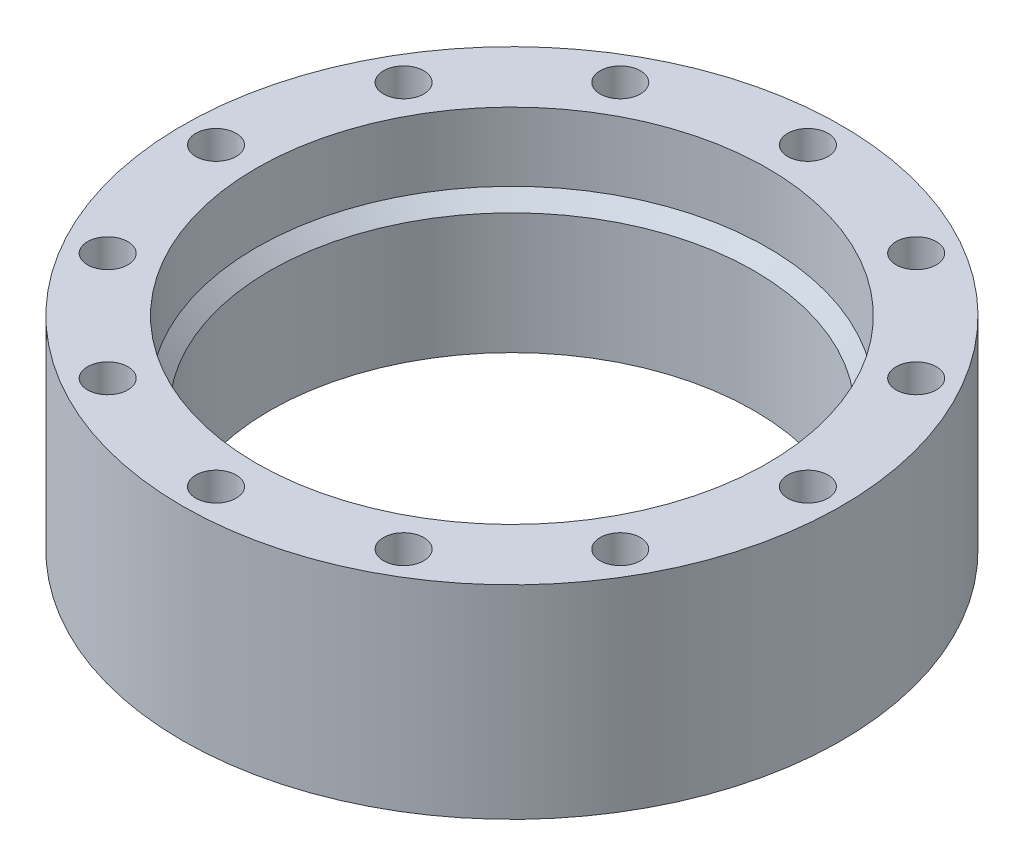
ISO-10303-21;
HEADER;
FILE_DESCRIPTION(('STEP AP214'),'2;1');
FILE_NAME('part.step','',(''),(''),'','','');
FILE_SCHEMA(('AUTOMOTIVE_DESIGN { 1 0 10303 214 1 1 1 1 }'));
ENDSEC;
DATA;
#1=APPLICATION_CONTEXT('core data for automotive mechanical design processes');
#2=APPLICATION_PROTOCOL_DEFINITION('international standard','automotive_design',2000,#1);
#3=PRODUCT_CONTEXT('',#1,'mechanical');
#4=PRODUCT('Part','Part','',(#3));
#5=PRODUCT_RELATED_PRODUCT_CATEGORY('part','',(#4));
#6=PRODUCT_DEFINITION_FORMATION('','',#4);
#7=PRODUCT_DEFINITION_CONTEXT('part definition',#1,'design');
#8=PRODUCT_DEFINITION('design','',#6,#7);
#9=PRODUCT_DEFINITION_SHAPE('','',#8);
#10=(LENGTH_UNIT() NAMED_UNIT(*) SI_UNIT(.MILLI.,.METRE.));
#11=(NAMED_UNIT(*) PLANE_ANGLE_UNIT() SI_UNIT($,.RADIAN.));
#12=(NAMED_UNIT(*) SI_UNIT($,.STERADIAN.) SOLID_ANGLE_UNIT());
#13=UNCERTAINTY_MEASURE_WITH_UNIT(LENGTH_MEASURE(1.E-05),#10,'distance_accuracy_value','');
#14=(GEOMETRIC_REPRESENTATION_CONTEXT(3) GLOBAL_UNCERTAINTY_ASSIGNED_CONTEXT((#13)) GLOBAL_UNIT_ASSIGNED_CONTEXT((#10,
#11,#12)) REPRESENTATION_CONTEXT('',''));
#15=CARTESIAN_POINT('',(0.,0.,0.));
#16=DIRECTION('',(0.,0.,1.));
#17=DIRECTION('',(1.,0.,0.));
#18=AXIS2_PLACEMENT_3D('',#15,#16,#17);
#19=CARTESIAN_POINT('',(0.,15.1,0.));
#20=DIRECTION('',(0.,1.,0.));
#21=DIRECTION('',(0.,0.,1.));
#22=AXIS2_PLACEMENT_3D('',#19,#20,#21);
#23=PLANE('',#22);
#24=CARTESIAN_POINT('',(-19.0525588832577,15.1,10.9999999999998));
#25=DIRECTION('',(0.,1.,0.));
#26=DIRECTION('',(0.,0.,1.));
#27=AXIS2_PLACEMENT_3D('',#24,#25,#26);
#28=CIRCLE('',#27,1.5);
#29=CARTESIAN_POINT('',(-19.0525588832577,15.1,12.4999999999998));
#30=VERTEX_POINT('',#29);
#31=EDGE_CURVE('E115',#30,#30,#28,.T.);
#32=ORIENTED_EDGE('',*,*,#31,.F.);
#33=EDGE_LOOP('',(#32));
#34=FACE_BOUND('',#33,.T.);
#35=CARTESIAN_POINT('',(-11.0000000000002,15.1,19.0525588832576));
#36=DIRECTION('',(0.,1.,0.));
#37=DIRECTION('',(0.,0.,1.));
#38=AXIS2_PLACEMENT_3D('',#35,#36,#37);
#39=CIRCLE('',#38,1.5);
#40=CARTESIAN_POINT('',(-11.0000000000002,15.1,20.5525588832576));
#41=VERTEX_POINT('',#40);
#42=EDGE_CURVE('E123',#41,#41,#39,.T.);
#43=ORIENTED_EDGE('',*,*,#42,.F.);
#44=EDGE_LOOP('',(#43));
#45=FACE_BOUND('',#44,.T.);
#46=CARTESIAN_POINT('',(-1.53602910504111E-13,15.1,22.));
#47=DIRECTION('',(0.,1.,0.));
#48=DIRECTION('',(0.,0.,1.));
#49=AXIS2_PLACEMENT_3D('',#46,#47,#48);
#50=CIRCLE('',#49,1.5);
#51=CARTESIAN_POINT('',(-1.53602910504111E-13,15.1,23.5));
#52=VERTEX_POINT('',#51);
#53=EDGE_CURVE('E129',#52,#52,#50,.T.);
#54=ORIENTED_EDGE('',*,*,#53,.F.);
#55=EDGE_LOOP('',(#54));
#56=FACE_BOUND('',#55,.T.);
#57=CARTESIAN_POINT('',(10.9999999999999,15.1,19.0525588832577));
#58=DIRECTION('',(0.,1.,0.));
#59=DIRECTION('',(0.,0.,1.));
#60=AXIS2_PLACEMENT_3D('',#57,#58,#59);
#61=CIRCLE('',#60,1.5);
#62=CARTESIAN_POINT('',(10.9999999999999,15.1,20.5525588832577));
#63=VERTEX_POINT('',#62);
#64=EDGE_CURVE('E83',#63,#63,#61,.T.);
#65=ORIENTED_EDGE('',*,*,#64,.F.);
#66=EDGE_LOOP('',(#65));
#67=FACE_BOUND('',#66,.T.);
#68=CARTESIAN_POINT('',(19.0525588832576,15.1,11.0000000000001));
#69=DIRECTION('',(0.,1.,0.));
#70=DIRECTION('',(0.,0.,1.));
#71=AXIS2_PLACEMENT_3D('',#68,#69,#70);
#72=CIRCLE('',#71,1.5);
#73=CARTESIAN_POINT('',(19.0525588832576,15.1,12.5000000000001));
#74=VERTEX_POINT('',#73);
#75=EDGE_CURVE('E76',#74,#74,#72,.T.);
#76=ORIENTED_EDGE('',*,*,#75,.F.);
#77=EDGE_LOOP('',(#76));
#78=FACE_BOUND('',#77,.T.);
#79=CARTESIAN_POINT('',(22.,15.1,0.));
#80=DIRECTION('',(0.,1.,0.));
#81=DIRECTION('',(0.,0.,1.));
#82=AXIS2_PLACEMENT_3D('',#79,#80,#81);
#83=CIRCLE('',#82,1.5);
#84=CARTESIAN_POINT('',(22.,15.1,1.50000000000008));
#85=VERTEX_POINT('',#84);
#86=EDGE_CURVE('E90',#85,#85,#83,.T.);
#87=ORIENTED_EDGE('',*,*,#86,.F.);
#88=EDGE_LOOP('',(#87));
#89=FACE_BOUND('',#88,.T.);
#90=CARTESIAN_POINT('',(19.0525588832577,15.1,-11.));
#91=DIRECTION('',(0.,1.,0.));
#92=DIRECTION('',(0.,0.,1.));
#93=AXIS2_PLACEMENT_3D('',#90,#91,#92);
#94=CIRCLE('',#93,1.5);
#95=CARTESIAN_POINT('',(19.0525588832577,15.1,-9.49999999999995));
#96=VERTEX_POINT('',#95);
#97=EDGE_CURVE('E100',#96,#96,#94,.T.);
#98=ORIENTED_EDGE('',*,*,#97,.F.);
#99=EDGE_LOOP('',(#98));
#100=FACE_BOUND('',#99,.T.);
#101=CARTESIAN_POINT('',(11.,15.1,-19.0525588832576));
#102=DIRECTION('',(0.,1.,0.));
#103=DIRECTION('',(0.,0.,1.));
#104=AXIS2_PLACEMENT_3D('',#101,#102,#103);
#105=CIRCLE('',#104,1.5);
#106=CARTESIAN_POINT('',(11.,15.1,-17.5525588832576));
#107=VERTEX_POINT('',#106);
#108=EDGE_CURVE('E75',#107,#107,#105,.T.);
#109=ORIENTED_EDGE('',*,*,#108,.F.);
#110=EDGE_LOOP('',(#109));
#111=FACE_BOUND('',#110,.T.);
#112=CARTESIAN_POINT('',(-22.,15.1,-2.3041549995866E-13));
#113=DIRECTION('',(0.,1.,0.));
#114=DIRECTION('',(0.,0.,1.));
#115=AXIS2_PLACEMENT_3D('',#112,#113,#114);
#116=CIRCLE('',#115,1.5);
#117=CARTESIAN_POINT('',(-22.,15.1,1.49999999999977));
#118=VERTEX_POINT('',#117);
#119=EDGE_CURVE('E114',#118,#118,#116,.T.);
#120=ORIENTED_EDGE('',*,*,#119,.F.);
#121=EDGE_LOOP('',(#120));
#122=FACE_BOUND('',#121,.T.);
#123=CARTESIAN_POINT('',(-19.0525588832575,15.1,-11.0000000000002));
#124=DIRECTION('',(0.,1.,0.));
#125=DIRECTION('',(0.,0.,1.));
#126=AXIS2_PLACEMENT_3D('',#123,#124,#125);
#127=CIRCLE('',#126,1.5);
#128=CARTESIAN_POINT('',(-19.0525588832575,15.1,-9.50000000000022));
#129=VERTEX_POINT('',#128);
#130=EDGE_CURVE('E153',#129,#129,#127,.T.);
#131=ORIENTED_EDGE('',*,*,#130,.F.);
#132=EDGE_LOOP('',(#131));
#133=FACE_BOUND('',#132,.T.);
#134=CARTESIAN_POINT('',(-10.9999999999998,15.1,-19.0525588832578));
#135=DIRECTION('',(0.,1.,0.));
#136=DIRECTION('',(0.,0.,1.));
#137=AXIS2_PLACEMENT_3D('',#134,#135,#136);
#138=CIRCLE('',#137,1.5);
#139=CARTESIAN_POINT('',(-10.9999999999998,15.1,-17.5525588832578));
#140=VERTEX_POINT('',#139);
#141=EDGE_CURVE('E145',#140,#140,#138,.T.);
#142=ORIENTED_EDGE('',*,*,#141,.F.);
#143=EDGE_LOOP('',(#142));
#144=FACE_BOUND('',#143,.T.);
#145=CARTESIAN_POINT('',(0.,15.1,-22.));
#146=DIRECTION('',(0.,1.,0.));
#147=DIRECTION('',(0.,0.,1.));
#148=AXIS2_PLACEMENT_3D('',#145,#146,#147);
#149=CIRCLE('',#148,1.5);
#150=CARTESIAN_POINT('',(0.,15.1,-20.5));
#151=VERTEX_POINT('',#150);
#152=EDGE_CURVE('E66',#151,#151,#149,.T.);
#153=ORIENTED_EDGE('',*,*,#152,.F.);
#154=EDGE_LOOP('',(#153));
#155=FACE_BOUND('',#154,.T.);
#156=CARTESIAN_POINT('',(0.,15.1,0.));
#157=DIRECTION('',(0.,1.,0.));
#158=DIRECTION('',(0.,0.,1.));
#159=AXIS2_PLACEMENT_3D('',#156,#157,#158);
#160=CIRCLE('',#159,24.5);
#161=CARTESIAN_POINT('',(0.,15.1,24.5));
#162=VERTEX_POINT('',#161);
#163=EDGE_CURVE('E51',#162,#162,#160,.T.);
#164=ORIENTED_EDGE('',*,*,#163,.T.);
#165=EDGE_LOOP('',(#164));
#166=FACE_BOUND('',#165,.T.);
#167=CARTESIAN_POINT('',(0.,15.1,0.));
#168=DIRECTION('',(0.,1.,0.));
#169=DIRECTION('',(0.,0.,1.));
#170=AXIS2_PLACEMENT_3D('',#167,#168,#169);
#171=CIRCLE('',#170,19.);
#172=CARTESIAN_POINT('',(0.,15.1,19.));
#173=VERTEX_POINT('',#172);
#174=EDGE_CURVE('E64',#173,#173,#171,.T.);
#175=ORIENTED_EDGE('',*,*,#174,.F.);
#176=EDGE_LOOP('',(#175));
#177=FACE_BOUND('',#176,.T.);
#178=ADVANCED_FACE('F43',(#34,#45,#56,#67,#78,#89,#100,#111,#122,#133,#144,#155,#166,#177),#23,.T.);
#179=CARTESIAN_POINT('',(0.,0.,0.));
#180=DIRECTION('',(0.,1.,0.));
#181=DIRECTION('',(0.,0.,1.));
#182=AXIS2_PLACEMENT_3D('',#179,#180,#181);
#183=PLANE('',#182);
#184=CARTESIAN_POINT('',(0.,0.,0.));
#185=DIRECTION('',(0.,1.,0.));
#186=DIRECTION('',(0.,0.,1.));
#187=AXIS2_PLACEMENT_3D('',#184,#185,#186);
#188=CIRCLE('',#187,24.5);
#189=CARTESIAN_POINT('',(0.,0.,24.5));
#190=VERTEX_POINT('',#189);
#191=EDGE_CURVE('E57',#190,#190,#188,.T.);
#192=ORIENTED_EDGE('',*,*,#191,.F.);
#193=EDGE_LOOP('',(#192));
#194=FACE_BOUND('',#193,.T.);
#195=CARTESIAN_POINT('',(0.,-1.80405208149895E-13,0.));
#196=DIRECTION('',(0.,-1.,0.));
#197=DIRECTION('',(1.,0.,0.));
#198=AXIS2_PLACEMENT_3D('',#195,#196,#197);
#199=CIRCLE('',#198,18.);
#200=CARTESIAN_POINT('',(18.,0.,0.));
#201=VERTEX_POINT('',#200);
#202=EDGE_CURVE('E144',#201,#201,#199,.T.);
#203=ORIENTED_EDGE('',*,*,#202,.F.);
#204=EDGE_LOOP('',(#203));
#205=FACE_BOUND('',#204,.T.);
#206=ADVANCED_FACE('F186',(#194,#205),#183,.F.);
#207=CARTESIAN_POINT('',(0.,15.1,0.));
#208=DIRECTION('',(0.,-1.,0.));
#209=DIRECTION('',(0.,0.,-1.));
#210=AXIS2_PLACEMENT_3D('',#207,#208,#209);
#211=CYLINDRICAL_SURFACE('',#210,24.5);
#212=ORIENTED_EDGE('',*,*,#163,.F.);
#213=EDGE_LOOP('',(#212));
#214=FACE_BOUND('',#213,.T.);
#215=ORIENTED_EDGE('',*,*,#191,.T.);
#216=EDGE_LOOP('',(#215));
#217=FACE_BOUND('',#216,.T.);
#218=ADVANCED_FACE('F44',(#214,#217),#211,.T.);
#219=CARTESIAN_POINT('',(0.,15.1,0.));
#220=DIRECTION('',(0.,-1.,0.));
#221=DIRECTION('',(0.,0.,-1.));
#222=AXIS2_PLACEMENT_3D('',#219,#220,#221);
#223=CYLINDRICAL_SURFACE('',#222,19.);
#224=CARTESIAN_POINT('',(-1.01670879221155E-13,9.99999999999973,0.));
#225=DIRECTION('',(0.,1.,0.));
#226=DIRECTION('',(-1.,0.,0.));
#227=AXIS2_PLACEMENT_3D('',#224,#225,#226);
#228=CIRCLE('',#227,19.);
#229=CARTESIAN_POINT('',(-19.0000000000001,9.99999999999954,0.));
#230=VERTEX_POINT('',#229);
#231=EDGE_CURVE('E10',#230,#230,#228,.T.);
#232=ORIENTED_EDGE('',*,*,#231,.F.);
#233=EDGE_LOOP('',(#232));
#234=FACE_BOUND('',#233,.T.);
#235=ORIENTED_EDGE('',*,*,#174,.T.);
#236=EDGE_LOOP('',(#235));
#237=FACE_BOUND('',#236,.T.);
#238=ADVANCED_FACE('F205',(#234,#237),#223,.F.);
#239=CARTESIAN_POINT('',(0.,10.1,-22.));
#240=DIRECTION('',(0.,1.,0.));
#241=DIRECTION('',(0.,0.,1.));
#242=AXIS2_PLACEMENT_3D('',#239,#240,#241);
#243=CYLINDRICAL_SURFACE('',#242,1.5);
#244=CARTESIAN_POINT('',(0.,10.1,-22.));
#245=DIRECTION('',(0.,1.,0.));
#246=DIRECTION('',(0.,0.,1.));
#247=AXIS2_PLACEMENT_3D('',#244,#245,#246);
#248=CIRCLE('',#247,1.5);
#249=CARTESIAN_POINT('',(0.,10.1,-20.5));
#250=VERTEX_POINT('',#249);
#251=EDGE_CURVE('E70',#250,#250,#248,.T.);
#252=ORIENTED_EDGE('',*,*,#251,.F.);
#253=EDGE_LOOP('',(#252));
#254=FACE_BOUND('',#253,.T.);
#255=ORIENTED_EDGE('',*,*,#152,.T.);
#256=EDGE_LOOP('',(#255));
#257=FACE_BOUND('',#256,.T.);
#258=ADVANCED_FACE('F204',(#254,#257),#243,.F.);
#259=CARTESIAN_POINT('',(0.,10.1,-22.));
#260=DIRECTION('',(0.,1.,0.));
#261=DIRECTION('',(0.,0.,1.));
#262=AXIS2_PLACEMENT_3D('',#259,#260,#261);
#263=PLANE('',#262);
#264=ORIENTED_EDGE('',*,*,#251,.T.);
#265=EDGE_LOOP('',(#264));
#266=FACE_BOUND('',#265,.T.);
#267=ADVANCED_FACE('F210',(#266),#263,.T.);
#268=CARTESIAN_POINT('',(-10.9999999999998,10.1,-19.0525588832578));
#269=DIRECTION('',(0.,1.,0.));
#270=DIRECTION('',(0.,0.,1.));
#271=AXIS2_PLACEMENT_3D('',#268,#269,#270);
#272=CYLINDRICAL_SURFACE('',#271,1.5);
#273=CARTESIAN_POINT('',(-10.9999999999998,10.1,-19.0525588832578));
#274=DIRECTION('',(0.,1.,0.));
#275=DIRECTION('',(0.,0.,1.));
#276=AXIS2_PLACEMENT_3D('',#273,#274,#275);
#277=CIRCLE('',#276,1.5);
#278=CARTESIAN_POINT('',(-10.9999999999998,10.1,-17.5525588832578));
#279=VERTEX_POINT('',#278);
#280=EDGE_CURVE('E139',#279,#279,#277,.T.);
#281=ORIENTED_EDGE('',*,*,#280,.F.);
#282=EDGE_LOOP('',(#281));
#283=FACE_BOUND('',#282,.T.);
#284=ORIENTED_EDGE('',*,*,#141,.T.);
#285=EDGE_LOOP('',(#284));
#286=FACE_BOUND('',#285,.T.);
#287=ADVANCED_FACE('F211',(#283,#286),#272,.F.);
#288=CARTESIAN_POINT('',(-10.9999999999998,10.1,-19.0525588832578));
#289=DIRECTION('',(0.,1.,0.));
#290=DIRECTION('',(0.,0.,1.));
#291=AXIS2_PLACEMENT_3D('',#288,#289,#290);
#292=PLANE('',#291);
#293=ORIENTED_EDGE('',*,*,#280,.T.);
#294=EDGE_LOOP('',(#293));
#295=FACE_BOUND('',#294,.T.);
#296=ADVANCED_FACE('F272',(#295),#292,.T.);
#297=CARTESIAN_POINT('',(-19.0525588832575,10.1,-11.0000000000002));
#298=DIRECTION('',(0.,1.,0.));
#299=DIRECTION('',(0.,0.,1.));
#300=AXIS2_PLACEMENT_3D('',#297,#298,#299);
#301=CYLINDRICAL_SURFACE('',#300,1.5);
#302=CARTESIAN_POINT('',(-19.0525588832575,10.1,-11.0000000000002));
#303=DIRECTION('',(0.,1.,0.));
#304=DIRECTION('',(0.,0.,1.));
#305=AXIS2_PLACEMENT_3D('',#302,#303,#304);
#306=CIRCLE('',#305,1.5);
#307=CARTESIAN_POINT('',(-19.0525588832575,10.1,-9.50000000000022));
#308=VERTEX_POINT('',#307);
#309=EDGE_CURVE('E149',#308,#308,#306,.T.);
#310=ORIENTED_EDGE('',*,*,#309,.F.);
#311=EDGE_LOOP('',(#310));
#312=FACE_BOUND('',#311,.T.);
#313=ORIENTED_EDGE('',*,*,#130,.T.);
#314=EDGE_LOOP('',(#313));
#315=FACE_BOUND('',#314,.T.);
#316=ADVANCED_FACE('F277',(#312,#315),#301,.F.);
#317=CARTESIAN_POINT('',(-19.0525588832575,10.1,-11.0000000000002));
#318=DIRECTION('',(0.,1.,0.));
#319=DIRECTION('',(0.,0.,1.));
#320=AXIS2_PLACEMENT_3D('',#317,#318,#319);
#321=PLANE('',#320);
#322=ORIENTED_EDGE('',*,*,#309,.T.);
#323=EDGE_LOOP('',(#322));
#324=FACE_BOUND('',#323,.T.);
#325=ADVANCED_FACE('F283',(#324),#321,.T.);
#326=CARTESIAN_POINT('',(-22.,10.1,-2.3041549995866E-13));
#327=DIRECTION('',(0.,1.,0.));
#328=DIRECTION('',(0.,0.,1.));
#329=AXIS2_PLACEMENT_3D('',#326,#327,#328);
#330=CYLINDRICAL_SURFACE('',#329,1.5);
#331=CARTESIAN_POINT('',(-22.,10.1,-2.3041549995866E-13));
#332=DIRECTION('',(0.,1.,0.));
#333=DIRECTION('',(0.,0.,1.));
#334=AXIS2_PLACEMENT_3D('',#331,#332,#333);
#335=CIRCLE('',#334,1.5);
#336=CARTESIAN_POINT('',(-22.,10.1,1.49999999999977));
#337=VERTEX_POINT('',#336);
#338=EDGE_CURVE('E160',#337,#337,#335,.T.);
#339=ORIENTED_EDGE('',*,*,#338,.F.);
#340=EDGE_LOOP('',(#339));
#341=FACE_BOUND('',#340,.T.);
#342=ORIENTED_EDGE('',*,*,#119,.T.);
#343=EDGE_LOOP('',(#342));
#344=FACE_BOUND('',#343,.T.);
#345=ADVANCED_FACE('F285',(#341,#344),#330,.F.);
#346=CARTESIAN_POINT('',(-22.,10.1,-2.3041549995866E-13));
#347=DIRECTION('',(0.,1.,0.));
#348=DIRECTION('',(0.,0.,1.));
#349=AXIS2_PLACEMENT_3D('',#346,#347,#348);
#350=PLANE('',#349);
#351=ORIENTED_EDGE('',*,*,#338,.T.);
#352=EDGE_LOOP('',(#351));
#353=FACE_BOUND('',#352,.T.);
#354=ADVANCED_FACE('F245',(#353),#350,.T.);
#355=CARTESIAN_POINT('',(11.,10.1,-19.0525588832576));
#356=DIRECTION('',(0.,1.,0.));
#357=DIRECTION('',(0.,0.,1.));
#358=AXIS2_PLACEMENT_3D('',#355,#356,#357);
#359=CYLINDRICAL_SURFACE('',#358,1.5);
#360=CARTESIAN_POINT('',(11.,10.1,-19.0525588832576));
#361=DIRECTION('',(0.,1.,0.));
#362=DIRECTION('',(0.,0.,1.));
#363=AXIS2_PLACEMENT_3D('',#360,#361,#362);
#364=CIRCLE('',#363,1.5);
#365=CARTESIAN_POINT('',(11.,10.1,-17.5525588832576));
#366=VERTEX_POINT('',#365);
#367=EDGE_CURVE('E101',#366,#366,#364,.T.);
#368=ORIENTED_EDGE('',*,*,#367,.F.);
#369=EDGE_LOOP('',(#368));
#370=FACE_BOUND('',#369,.T.);
#371=ORIENTED_EDGE('',*,*,#108,.T.);
#372=EDGE_LOOP('',(#371));
#373=FACE_BOUND('',#372,.T.);
#374=ADVANCED_FACE('F243',(#370,#373),#359,.F.);
#375=CARTESIAN_POINT('',(11.,10.1,-19.0525588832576));
#376=DIRECTION('',(0.,1.,0.));
#377=DIRECTION('',(0.,0.,1.));
#378=AXIS2_PLACEMENT_3D('',#375,#376,#377);
#379=PLANE('',#378);
#380=ORIENTED_EDGE('',*,*,#367,.T.);
#381=EDGE_LOOP('',(#380));
#382=FACE_BOUND('',#381,.T.);
#383=ADVANCED_FACE('F240',(#382),#379,.T.);
#384=CARTESIAN_POINT('',(19.0525588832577,10.1,-11.));
#385=DIRECTION('',(0.,1.,0.));
#386=DIRECTION('',(0.,0.,1.));
#387=AXIS2_PLACEMENT_3D('',#384,#385,#386);
#388=CYLINDRICAL_SURFACE('',#387,1.5);
#389=CARTESIAN_POINT('',(19.0525588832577,10.1,-11.));
#390=DIRECTION('',(0.,1.,0.));
#391=DIRECTION('',(0.,0.,1.));
#392=AXIS2_PLACEMENT_3D('',#389,#390,#391);
#393=CIRCLE('',#392,1.5);
#394=CARTESIAN_POINT('',(19.0525588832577,10.1,-9.49999999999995));
#395=VERTEX_POINT('',#394);
#396=EDGE_CURVE('E91',#395,#395,#393,.T.);
#397=ORIENTED_EDGE('',*,*,#396,.F.);
#398=EDGE_LOOP('',(#397));
#399=FACE_BOUND('',#398,.T.);
#400=ORIENTED_EDGE('',*,*,#97,.T.);
#401=EDGE_LOOP('',(#400));
#402=FACE_BOUND('',#401,.T.);
#403=ADVANCED_FACE('F231',(#399,#402),#388,.F.);
#404=CARTESIAN_POINT('',(19.0525588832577,10.1,-11.));
#405=DIRECTION('',(0.,1.,0.));
#406=DIRECTION('',(0.,0.,1.));
#407=AXIS2_PLACEMENT_3D('',#404,#405,#406);
#408=PLANE('',#407);
#409=ORIENTED_EDGE('',*,*,#396,.T.);
#410=EDGE_LOOP('',(#409));
#411=FACE_BOUND('',#410,.T.);
#412=ADVANCED_FACE('F230',(#411),#408,.T.);
#413=CARTESIAN_POINT('',(22.,10.1,0.));
#414=DIRECTION('',(0.,1.,0.));
#415=DIRECTION('',(0.,0.,1.));
#416=AXIS2_PLACEMENT_3D('',#413,#414,#415);
#417=CYLINDRICAL_SURFACE('',#416,1.5);
#418=CARTESIAN_POINT('',(22.,10.1,0.));
#419=DIRECTION('',(0.,1.,0.));
#420=DIRECTION('',(0.,0.,1.));
#421=AXIS2_PLACEMENT_3D('',#418,#419,#420);
#422=CIRCLE('',#421,1.5);
#423=CARTESIAN_POINT('',(22.,10.1,1.50000000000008));
#424=VERTEX_POINT('',#423);
#425=EDGE_CURVE('E84',#424,#424,#422,.T.);
#426=ORIENTED_EDGE('',*,*,#425,.F.);
#427=EDGE_LOOP('',(#426));
#428=FACE_BOUND('',#427,.T.);
#429=ORIENTED_EDGE('',*,*,#86,.T.);
#430=EDGE_LOOP('',(#429));
#431=FACE_BOUND('',#430,.T.);
#432=ADVANCED_FACE('F223',(#428,#431),#417,.F.);
#433=CARTESIAN_POINT('',(22.,10.1,0.));
#434=DIRECTION('',(0.,1.,0.));
#435=DIRECTION('',(0.,0.,1.));
#436=AXIS2_PLACEMENT_3D('',#433,#434,#435);
#437=PLANE('',#436);
#438=ORIENTED_EDGE('',*,*,#425,.T.);
#439=EDGE_LOOP('',(#438));
#440=FACE_BOUND('',#439,.T.);
#441=ADVANCED_FACE('F222',(#440),#437,.T.);
#442=CARTESIAN_POINT('',(19.0525588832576,10.1,11.0000000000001));
#443=DIRECTION('',(0.,1.,0.));
#444=DIRECTION('',(0.,0.,1.));
#445=AXIS2_PLACEMENT_3D('',#442,#443,#444);
#446=CYLINDRICAL_SURFACE('',#445,1.5);
#447=CARTESIAN_POINT('',(19.0525588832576,10.1,11.0000000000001));
#448=DIRECTION('',(0.,1.,0.));
#449=DIRECTION('',(0.,0.,1.));
#450=AXIS2_PLACEMENT_3D('',#447,#448,#449);
#451=CIRCLE('',#450,1.5);
#452=CARTESIAN_POINT('',(19.0525588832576,10.1,12.5000000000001));
#453=VERTEX_POINT('',#452);
#454=EDGE_CURVE('E78',#453,#453,#451,.T.);
#455=ORIENTED_EDGE('',*,*,#454,.F.);
#456=EDGE_LOOP('',(#455));
#457=FACE_BOUND('',#456,.T.);
#458=ORIENTED_EDGE('',*,*,#75,.T.);
#459=EDGE_LOOP('',(#458));
#460=FACE_BOUND('',#459,.T.);
#461=ADVANCED_FACE('F220',(#457,#460),#446,.F.);
#462=CARTESIAN_POINT('',(19.0525588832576,10.1,11.0000000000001));
#463=DIRECTION('',(0.,1.,0.));
#464=DIRECTION('',(0.,0.,1.));
#465=AXIS2_PLACEMENT_3D('',#462,#463,#464);
#466=PLANE('',#465);
#467=ORIENTED_EDGE('',*,*,#454,.T.);
#468=EDGE_LOOP('',(#467));
#469=FACE_BOUND('',#468,.T.);
#470=ADVANCED_FACE('F213',(#469),#466,.T.);
#471=CARTESIAN_POINT('',(10.9999999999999,10.1,19.0525588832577));
#472=DIRECTION('',(0.,1.,0.));
#473=DIRECTION('',(0.,0.,1.));
#474=AXIS2_PLACEMENT_3D('',#471,#472,#473);
#475=CYLINDRICAL_SURFACE('',#474,1.5);
#476=CARTESIAN_POINT('',(10.9999999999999,10.1,19.0525588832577));
#477=DIRECTION('',(0.,1.,0.));
#478=DIRECTION('',(0.,0.,1.));
#479=AXIS2_PLACEMENT_3D('',#476,#477,#478);
#480=CIRCLE('',#479,1.5);
#481=CARTESIAN_POINT('',(10.9999999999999,10.1,20.5525588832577));
#482=VERTEX_POINT('',#481);
#483=EDGE_CURVE('E132',#482,#482,#480,.T.);
#484=ORIENTED_EDGE('',*,*,#483,.F.);
#485=EDGE_LOOP('',(#484));
#486=FACE_BOUND('',#485,.T.);
#487=ORIENTED_EDGE('',*,*,#64,.T.);
#488=EDGE_LOOP('',(#487));
#489=FACE_BOUND('',#488,.T.);
#490=ADVANCED_FACE('F216',(#486,#489),#475,.F.);
#491=CARTESIAN_POINT('',(10.9999999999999,10.1,19.0525588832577));
#492=DIRECTION('',(0.,1.,0.));
#493=DIRECTION('',(0.,0.,1.));
#494=AXIS2_PLACEMENT_3D('',#491,#492,#493);
#495=PLANE('',#494);
#496=ORIENTED_EDGE('',*,*,#483,.T.);
#497=EDGE_LOOP('',(#496));
#498=FACE_BOUND('',#497,.T.);
#499=ADVANCED_FACE('F264',(#498),#495,.T.);
#500=CARTESIAN_POINT('',(-1.53602910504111E-13,10.1,22.));
#501=DIRECTION('',(0.,1.,0.));
#502=DIRECTION('',(0.,0.,1.));
#503=AXIS2_PLACEMENT_3D('',#500,#501,#502);
#504=CYLINDRICAL_SURFACE('',#503,1.5);
#505=CARTESIAN_POINT('',(-1.53602910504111E-13,10.1,22.));
#506=DIRECTION('',(0.,1.,0.));
#507=DIRECTION('',(0.,0.,1.));
#508=AXIS2_PLACEMENT_3D('',#505,#506,#507);
#509=CIRCLE('',#508,1.5);
#510=CARTESIAN_POINT('',(-1.53602910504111E-13,10.1,23.5));
#511=VERTEX_POINT('',#510);
#512=EDGE_CURVE('E124',#511,#511,#509,.T.);
#513=ORIENTED_EDGE('',*,*,#512,.F.);
#514=EDGE_LOOP('',(#513));
#515=FACE_BOUND('',#514,.T.);
#516=ORIENTED_EDGE('',*,*,#53,.T.);
#517=EDGE_LOOP('',(#516));
#518=FACE_BOUND('',#517,.T.);
#519=ADVANCED_FACE('F261',(#515,#518),#504,.F.);
#520=CARTESIAN_POINT('',(-1.53602910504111E-13,10.1,22.));
#521=DIRECTION('',(0.,1.,0.));
#522=DIRECTION('',(0.,0.,1.));
#523=AXIS2_PLACEMENT_3D('',#520,#521,#522);
#524=PLANE('',#523);
#525=ORIENTED_EDGE('',*,*,#512,.T.);
#526=EDGE_LOOP('',(#525));
#527=FACE_BOUND('',#526,.T.);
#528=ADVANCED_FACE('F260',(#527),#524,.T.);
#529=CARTESIAN_POINT('',(-11.0000000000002,10.1,19.0525588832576));
#530=DIRECTION('',(0.,1.,0.));
#531=DIRECTION('',(0.,0.,1.));
#532=AXIS2_PLACEMENT_3D('',#529,#530,#531);
#533=CYLINDRICAL_SURFACE('',#532,1.5);
#534=CARTESIAN_POINT('',(-11.0000000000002,10.1,19.0525588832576));
#535=DIRECTION('',(0.,1.,0.));
#536=DIRECTION('',(0.,0.,1.));
#537=AXIS2_PLACEMENT_3D('',#534,#535,#536);
#538=CIRCLE('',#537,1.5);
#539=CARTESIAN_POINT('',(-11.0000000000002,10.1,20.5525588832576));
#540=VERTEX_POINT('',#539);
#541=EDGE_CURVE('E119',#540,#540,#538,.T.);
#542=ORIENTED_EDGE('',*,*,#541,.F.);
#543=EDGE_LOOP('',(#542));
#544=FACE_BOUND('',#543,.T.);
#545=ORIENTED_EDGE('',*,*,#42,.T.);
#546=EDGE_LOOP('',(#545));
#547=FACE_BOUND('',#546,.T.);
#548=ADVANCED_FACE('F251',(#544,#547),#533,.F.);
#549=CARTESIAN_POINT('',(-11.0000000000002,10.1,19.0525588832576));
#550=DIRECTION('',(0.,1.,0.));
#551=DIRECTION('',(0.,0.,1.));
#552=AXIS2_PLACEMENT_3D('',#549,#550,#551);
#553=PLANE('',#552);
#554=ORIENTED_EDGE('',*,*,#541,.T.);
#555=EDGE_LOOP('',(#554));
#556=FACE_BOUND('',#555,.T.);
#557=ADVANCED_FACE('F247',(#556),#553,.T.);
#558=CARTESIAN_POINT('',(-19.0525588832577,10.1,10.9999999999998));
#559=DIRECTION('',(0.,1.,0.));
#560=DIRECTION('',(0.,0.,1.));
#561=AXIS2_PLACEMENT_3D('',#558,#559,#560);
#562=CYLINDRICAL_SURFACE('',#561,1.5);
#563=CARTESIAN_POINT('',(-19.0525588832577,10.1,10.9999999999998));
#564=DIRECTION('',(0.,1.,0.));
#565=DIRECTION('',(0.,0.,1.));
#566=AXIS2_PLACEMENT_3D('',#563,#564,#565);
#567=CIRCLE('',#566,1.5);
#568=CARTESIAN_POINT('',(-19.0525588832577,10.1,12.4999999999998));
#569=VERTEX_POINT('',#568);
#570=EDGE_CURVE('E107',#569,#569,#567,.T.);
#571=ORIENTED_EDGE('',*,*,#570,.F.);
#572=EDGE_LOOP('',(#571));
#573=FACE_BOUND('',#572,.T.);
#574=ORIENTED_EDGE('',*,*,#31,.T.);
#575=EDGE_LOOP('',(#574));
#576=FACE_BOUND('',#575,.T.);
#577=ADVANCED_FACE('F183',(#573,#576),#562,.F.);
#578=CARTESIAN_POINT('',(-19.0525588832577,10.1,10.9999999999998));
#579=DIRECTION('',(0.,1.,0.));
#580=DIRECTION('',(0.,0.,1.));
#581=AXIS2_PLACEMENT_3D('',#578,#579,#580);
#582=PLANE('',#581);
#583=ORIENTED_EDGE('',*,*,#570,.T.);
#584=EDGE_LOOP('',(#583));
#585=FACE_BOUND('',#584,.T.);
#586=ADVANCED_FACE('F178',(#585),#582,.T.);
#587=CARTESIAN_POINT('',(0.,0.,0.));
#588=DIRECTION('',(0.,-1.,0.));
#589=DIRECTION('',(1.,0.,0.));
#590=AXIS2_PLACEMENT_3D('',#587,#588,#589);
#591=CYLINDRICAL_SURFACE('',#590,18.);
#592=ORIENTED_EDGE('',*,*,#202,.T.);
#593=EDGE_LOOP('',(#592));
#594=FACE_BOUND('',#593,.T.);
#595=CARTESIAN_POINT('',(0.,8.99999999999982,0.));
#596=DIRECTION('',(0.,-1.,0.));
#597=DIRECTION('',(1.,0.,0.));
#598=AXIS2_PLACEMENT_3D('',#595,#596,#597);
#599=CIRCLE('',#598,18.0000000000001);
#600=CARTESIAN_POINT('',(18.,9.,0.));
#601=VERTEX_POINT('',#600);
#602=EDGE_CURVE('E170',#601,#601,#599,.T.);
#603=ORIENTED_EDGE('',*,*,#602,.F.);
#604=EDGE_LOOP('',(#603));
#605=FACE_BOUND('',#604,.T.);
#606=ADVANCED_FACE('F175',(#594,#605),#591,.F.);
#607=CARTESIAN_POINT('',(-1.01670879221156E-13,9.99999999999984,0.));
#608=DIRECTION('',(0.,1.,0.));
#609=DIRECTION('',(-1.,0.,0.));
#610=AXIS2_PLACEMENT_3D('',#607,#608,#609);
#611=CONICAL_SURFACE('',#610,19.0000000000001,0.785398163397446);
#612=ORIENTED_EDGE('',*,*,#602,.T.);
#613=EDGE_LOOP('',(#612));
#614=FACE_BOUND('',#613,.T.);
#615=ORIENTED_EDGE('',*,*,#231,.T.);
#616=EDGE_LOOP('',(#615));
#617=FACE_BOUND('',#616,.T.);
#618=ADVANCED_FACE('F174',(#614,#617),#611,.F.);
#619=CLOSED_SHELL('',(#178,#206,#218,#238,#258,#267,#287,#296,#316,#325,#345,#354,#374,#383,
#403,#412,#432,#441,#461,#470,#490,#499,#519,#528,#548,#557,#577,#586,#606,#618));
#620=MANIFOLD_SOLID_BREP('B2',#619);
#621=ADVANCED_BREP_SHAPE_REPRESENTATION('',(#18,#620),#14);
#622=SHAPE_DEFINITION_REPRESENTATION(#9,#621);
ENDSEC;
END-ISO-10303-21;
